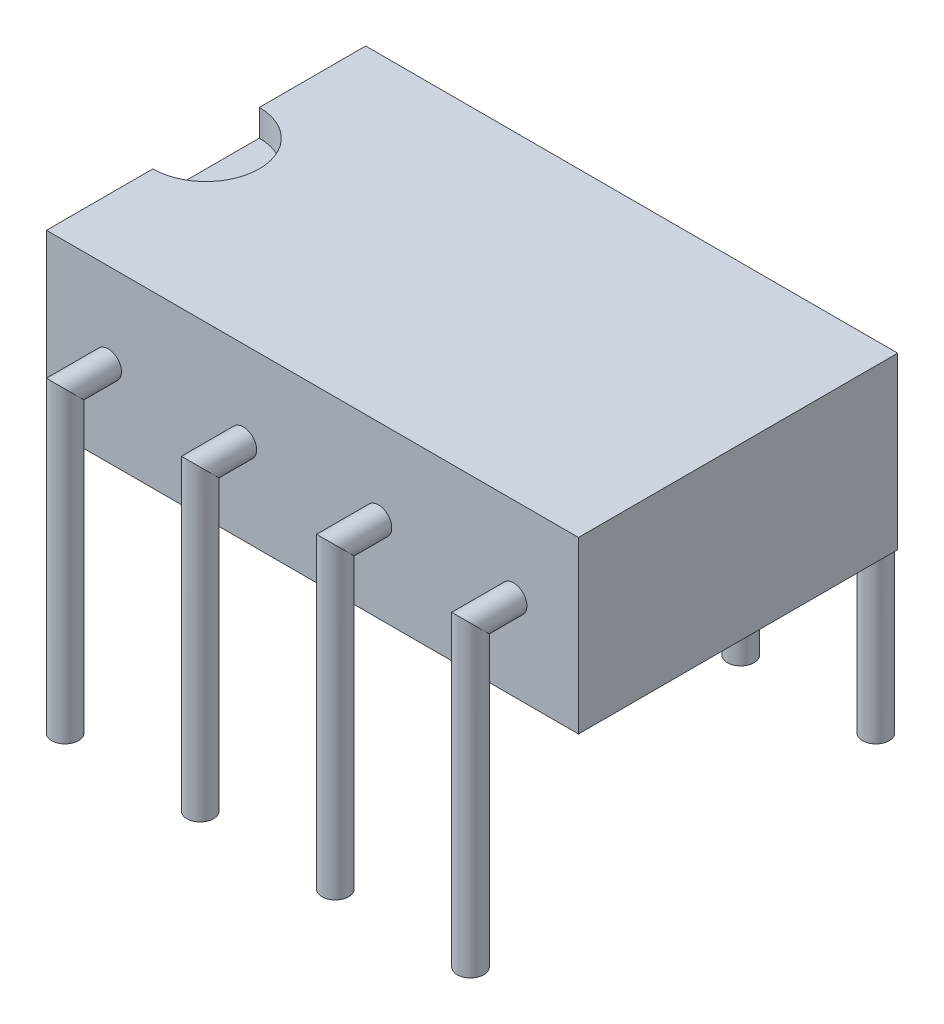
from build123d import *

# Parameters (mm, degrees)
ESQUISSE1_W                          = 6
ESQUISSE1_H                          = 3.2
EXTRUSION1_DEPTH                     = 10
ENL_V_MAT_EXTRU_1_DEPTH              = 0.5
ESQUISSE3_R                          = 0.25
R_P_TITION_LIN_AIRE1_COUNT           = 4
R_P_TITION_LIN_AIRE1_PITCH           = 2.54
R_P_TITION_LIN_AIRE1_COPY_1_SKETCH_R = 0.25
R_P_TITION_LIN_AIRE1_COPY_2_SKETCH_R = 0.25
R_P_TITION_LIN_AIRE1_COPY_3_SKETCH_R = 0.25


with BuildPart() as part:
    # Esquisse1 → Extrusion1 (new body)
    with BuildSketch(Plane(origin=(0, 0, 0), x_dir=(0, 0, -1), z_dir=(1, 0, 0))):
        with Locations((0, 1.6)):
            Rectangle(ESQUISSE1_W, ESQUISSE1_H)
    extrude(amount=EXTRUSION1_DEPTH)

    # Esquisse2 → Enl_v. mat.-Extru.1 (cut)
    with BuildSketch(Plane(origin=(0, 3.2, 0), x_dir=(-1, 0, 0), z_dir=(0, 1, 0))):
        with BuildLine():
            Line((0, -1), (0, 1))
            ThreePointArc((0, 1), (-1, 0), (0, -1))
        make_face()
    extrude(amount=-ENL_V_MAT_EXTRU_1_DEPTH, mode=Mode.SUBTRACT)

    # Balayage1: sweep along a path in Esquisse5
    with BuildLine(Plane(origin=(1.16, 0, 0), x_dir=(0, 0, -1), z_dir=(1, 0, 0))) as balayage1_path:
        Line((-3, 1.6), (-3.81, 1.6))
        Line((-3.81, 1.6), (-3.81, -4))
    # Esquisse3 → Balayage1 (sweep)
    with BuildSketch(Plane.XY.offset(3)):
        with Locations((1.16, 1.6)):
            Circle(ESQUISSE3_R)
    balayage1 = sweep(path=balayage1_path.line, transition=Transition.RIGHT)

    # Sym_trie1: Balayage1 across plane
    add(balayage1.mirror(Plane.XY))

    # R_p_tition lin_aire1: Balayage1 ×4
    with Locations(*[(i * R_P_TITION_LIN_AIRE1_PITCH, 0, 0) for i in range(1, R_P_TITION_LIN_AIRE1_COUNT)]):
        add(balayage1)

    # R_p_tition lin_aire1 copy 1: sweep along a path in R_p_tition lin_aire1 copy 1 path
    with BuildLine(Plane(origin=(3.7, 0, 0), x_dir=(0, 0, 1), z_dir=(1, 0, 0))) as r_p_tition_lin_aire1_copy_1_path:
        Line((-3, -1.6), (-3.81, -1.6))
        Line((-3.81, -1.6), (-3.81, 4))
    # R_p_tition lin_aire1 copy 1 sketch → R_p_tition lin_aire1 copy 1 (sweep)
    with BuildSketch(Plane(origin=(2.54, 0, -3), x_dir=(1, 0, 0), z_dir=(0, 0, -1))):
        with Locations((1.16, -1.6)):
            Circle(R_P_TITION_LIN_AIRE1_COPY_1_SKETCH_R)
    sweep(path=r_p_tition_lin_aire1_copy_1_path.line, transition=Transition.RIGHT)

    # R_p_tition lin_aire1 copy 2: sweep along a path in R_p_tition lin_aire1 copy 2 path
    with BuildLine(Plane(origin=(6.24, 0, 0), x_dir=(0, 0, 1), z_dir=(1, 0, 0))) as r_p_tition_lin_aire1_copy_2_path:
        Line((-3, -1.6), (-3.81, -1.6))
        Line((-3.81, -1.6), (-3.81, 4))
    # R_p_tition lin_aire1 copy 2 sketch → R_p_tition lin_aire1 copy 2 (sweep)
    with BuildSketch(Plane(origin=(5.08, 0, -3), x_dir=(1, 0, 0), z_dir=(0, 0, -1))):
        with Locations((1.16, -1.6)):
            Circle(R_P_TITION_LIN_AIRE1_COPY_2_SKETCH_R)
    sweep(path=r_p_tition_lin_aire1_copy_2_path.line, transition=Transition.RIGHT)

    # R_p_tition lin_aire1 copy 3: sweep along a path in R_p_tition lin_aire1 copy 3 path
    with BuildLine(Plane(origin=(8.78, 0, 0), x_dir=(0, 0, 1), z_dir=(1, 0, 0))) as r_p_tition_lin_aire1_copy_3_path:
        Line((-3, -1.6), (-3.81, -1.6))
        Line((-3.81, -1.6), (-3.81, 4))
    # R_p_tition lin_aire1 copy 3 sketch → R_p_tition lin_aire1 copy 3 (sweep)
    with BuildSketch(Plane(origin=(7.62, 0, -3), x_dir=(1, 0, 0), z_dir=(0, 0, -1))):
        with Locations((1.16, -1.6)):
            Circle(R_P_TITION_LIN_AIRE1_COPY_3_SKETCH_R)
    sweep(path=r_p_tition_lin_aire1_copy_3_path.line, transition=Transition.RIGHT)


solid = part.part
